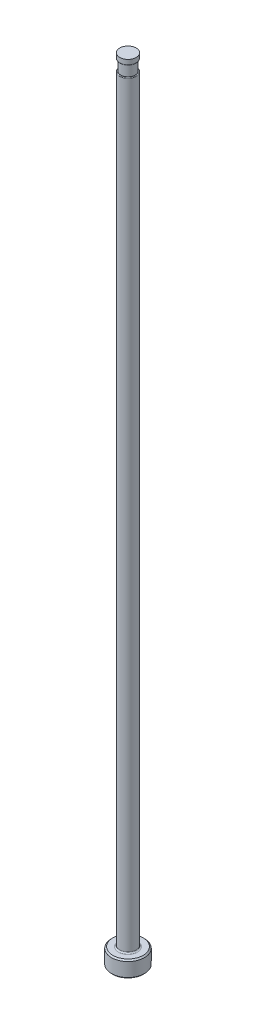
ISO-10303-21;
HEADER;
FILE_DESCRIPTION(('STEP AP214'),'2;1');
FILE_NAME('part.step','',(''),(''),'','','');
FILE_SCHEMA(('AUTOMOTIVE_DESIGN { 1 0 10303 214 1 1 1 1 }'));
ENDSEC;
DATA;
#1=APPLICATION_CONTEXT('core data for automotive mechanical design processes');
#2=APPLICATION_PROTOCOL_DEFINITION('international standard','automotive_design',2000,#1);
#3=PRODUCT_CONTEXT('',#1,'mechanical');
#4=PRODUCT('Part','Part','',(#3));
#5=PRODUCT_RELATED_PRODUCT_CATEGORY('part','',(#4));
#6=PRODUCT_DEFINITION_FORMATION('','',#4);
#7=PRODUCT_DEFINITION_CONTEXT('part definition',#1,'design');
#8=PRODUCT_DEFINITION('design','',#6,#7);
#9=PRODUCT_DEFINITION_SHAPE('','',#8);
#10=(LENGTH_UNIT() NAMED_UNIT(*) SI_UNIT(.MILLI.,.METRE.));
#11=(NAMED_UNIT(*) PLANE_ANGLE_UNIT() SI_UNIT($,.RADIAN.));
#12=(NAMED_UNIT(*) SI_UNIT($,.STERADIAN.) SOLID_ANGLE_UNIT());
#13=UNCERTAINTY_MEASURE_WITH_UNIT(LENGTH_MEASURE(1.E-05),#10,'distance_accuracy_value','');
#14=(GEOMETRIC_REPRESENTATION_CONTEXT(3) GLOBAL_UNCERTAINTY_ASSIGNED_CONTEXT((#13)) GLOBAL_UNIT_ASSIGNED_CONTEXT((#10,
#11,#12)) REPRESENTATION_CONTEXT('',''));
#15=CARTESIAN_POINT('',(0.,0.,0.));
#16=DIRECTION('',(0.,0.,1.));
#17=DIRECTION('',(1.,0.,0.));
#18=AXIS2_PLACEMENT_3D('',#15,#16,#17);
#19=CARTESIAN_POINT('',(-1.58749999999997,151.384,0.));
#20=DIRECTION('',(0.,1.,0.));
#21=DIRECTION('',(0.,0.,1.));
#22=AXIS2_PLACEMENT_3D('',#19,#20,#21);
#23=PLANE('',#22);
#24=CARTESIAN_POINT('',(0.,151.384,0.));
#25=DIRECTION('',(0.,1.,0.));
#26=DIRECTION('',(0.,0.,1.));
#27=AXIS2_PLACEMENT_3D('',#24,#25,#26);
#28=CIRCLE('',#27,1.45541999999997);
#29=CARTESIAN_POINT('',(0.,151.384,1.45541999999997));
#30=VERTEX_POINT('',#29);
#31=EDGE_CURVE('E11',#30,#30,#28,.F.);
#32=ORIENTED_EDGE('',*,*,#31,.T.);
#33=EDGE_LOOP('',(#32));
#34=FACE_BOUND('',#33,.T.);
#35=CARTESIAN_POINT('',(0.,151.384,0.));
#36=DIRECTION('',(0.,1.,0.));
#37=DIRECTION('',(0.,0.,1.));
#38=AXIS2_PLACEMENT_3D('',#35,#36,#37);
#39=CIRCLE('',#38,1.38429999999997);
#40=CARTESIAN_POINT('',(0.,151.384,1.38429999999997));
#41=VERTEX_POINT('',#40);
#42=EDGE_CURVE('E78',#41,#41,#39,.T.);
#43=ORIENTED_EDGE('',*,*,#42,.T.);
#44=EDGE_LOOP('',(#43));
#45=FACE_BOUND('',#44,.T.);
#46=ADVANCED_FACE('F36',(#34,#45),#23,.F.);
#47=CARTESIAN_POINT('',(0.,259.958771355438,0.));
#48=DIRECTION('',(0.,1.,0.));
#49=DIRECTION('',(0.,0.,1.));
#50=AXIS2_PLACEMENT_3D('',#47,#48,#49);
#51=CYLINDRICAL_SURFACE('',#50,1.58749999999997);
#52=DIRECTION('',(0.,1.,0.));
#53=VECTOR('',#52,1.);
#54=CARTESIAN_POINT('',(-1.38429999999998,259.958771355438,-0.777090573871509));
#55=LINE('',#54,#53);
#56=CARTESIAN_POINT('',(-1.38429999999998,149.225,-0.777090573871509));
#57=VERTEX_POINT('',#56);
#58=CARTESIAN_POINT('',(-1.38429999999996,86.868,-0.777090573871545));
#59=VERTEX_POINT('',#58);
#60=EDGE_CURVE('E73',#57,#59,#55,.F.);
#61=ORIENTED_EDGE('',*,*,#60,.F.);
#62=CARTESIAN_POINT('',(0.,149.225,0.));
#63=DIRECTION('',(0.,-1.,0.));
#64=DIRECTION('',(0.,0.,-1.));
#65=AXIS2_PLACEMENT_3D('',#62,#63,#64);
#66=CIRCLE('',#65,1.58749999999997);
#67=CARTESIAN_POINT('',(-1.38429999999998,149.225,0.777090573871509));
#68=VERTEX_POINT('',#67);
#69=EDGE_CURVE('E51',#57,#68,#66,.T.);
#70=ORIENTED_EDGE('',*,*,#69,.T.);
#71=DIRECTION('',(0.,1.,0.));
#72=VECTOR('',#71,1.);
#73=CARTESIAN_POINT('',(-1.38429999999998,259.958771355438,0.777090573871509));
#74=LINE('',#73,#72);
#75=CARTESIAN_POINT('',(-1.38429999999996,86.868,0.777090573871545));
#76=VERTEX_POINT('',#75);
#77=EDGE_CURVE('E84',#76,#68,#74,.T.);
#78=ORIENTED_EDGE('',*,*,#77,.F.);
#79=CARTESIAN_POINT('',(-1.38429999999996,86.868,-0.777090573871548));
#80=CARTESIAN_POINT('',(-1.38429609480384,86.8307272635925,-0.777082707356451));
#81=CARTESIAN_POINT('',(-1.38495631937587,86.7934527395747,-0.775921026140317));
#82=CARTESIAN_POINT('',(-1.38757712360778,86.7190763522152,-0.771232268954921));
#83=CARTESIAN_POINT('',(-1.38953849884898,86.6819746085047,-0.767703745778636));
#84=CARTESIAN_POINT('',(-1.39477495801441,86.6075790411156,-0.758148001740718));
#85=CARTESIAN_POINT('',(-1.39807044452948,86.570291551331,-0.752081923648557));
#86=CARTESIAN_POINT('',(-1.40590319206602,86.4963849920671,-0.737333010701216));
#87=CARTESIAN_POINT('',(-1.41044024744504,86.4597658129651,-0.728650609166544));
#88=CARTESIAN_POINT('',(-1.42582382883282,86.350986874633,-0.698367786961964));
#89=CARTESIAN_POINT('',(-1.43842338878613,86.2801687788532,-0.672562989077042));
#90=CARTESIAN_POINT('',(-1.46680838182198,86.1456572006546,-0.608160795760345));
#91=CARTESIAN_POINT('',(-1.48256997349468,86.0819156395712,-0.569657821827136));
#92=CARTESIAN_POINT('',(-1.50737283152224,85.9919333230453,-0.498685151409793));
#93=CARTESIAN_POINT('',(-1.51626333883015,85.9616802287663,-0.471232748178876));
#94=CARTESIAN_POINT('',(-1.53347485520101,85.9057865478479,-0.411785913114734));
#95=CARTESIAN_POINT('',(-1.54179640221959,85.8801415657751,-0.379795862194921));
#96=CARTESIAN_POINT('',(-1.55583338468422,85.8383277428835,-0.316871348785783));
#97=CARTESIAN_POINT('',(-1.56175286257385,85.8213042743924,-0.28655344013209));
#98=CARTESIAN_POINT('',(-1.57203785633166,85.79230135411,-0.223329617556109));
#99=CARTESIAN_POINT('',(-1.57640406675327,85.7803196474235,-0.190424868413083));
#100=CARTESIAN_POINT('',(-1.58312350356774,85.7620632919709,-0.122641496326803));
#101=CARTESIAN_POINT('',(-1.58546485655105,85.7558222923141,-0.0877524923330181));
#102=CARTESIAN_POINT('',(-1.58779523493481,85.7496097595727,-0.0173445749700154));
#103=CARTESIAN_POINT('',(-1.58778524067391,85.7496356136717,0.0181740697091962));
#104=CARTESIAN_POINT('',(-1.58553927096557,85.7556246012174,0.0850166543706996));
#105=CARTESIAN_POINT('',(-1.58352667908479,85.7609919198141,0.116403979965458));
#106=CARTESIAN_POINT('',(-1.57781194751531,85.7764774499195,0.177812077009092));
#107=CARTESIAN_POINT('',(-1.57410971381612,85.7865959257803,0.20783277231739));
#108=CARTESIAN_POINT('',(-1.56522233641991,85.8114483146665,0.266740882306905));
#109=CARTESIAN_POINT('',(-1.55999564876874,85.8263128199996,0.295566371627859));
#110=CARTESIAN_POINT('',(-1.54854541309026,85.8598843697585,0.350651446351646));
#111=CARTESIAN_POINT('',(-1.54232137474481,85.8785933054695,0.376909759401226));
#112=CARTESIAN_POINT('',(-1.52624085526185,85.928770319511,0.438380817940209));
#113=CARTESIAN_POINT('',(-1.51605337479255,85.9620994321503,0.471992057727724));
#114=CARTESIAN_POINT('',(-1.49561074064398,86.0338332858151,0.533246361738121));
#115=CARTESIAN_POINT('',(-1.48535548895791,86.0722487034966,0.560876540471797));
#116=CARTESIAN_POINT('',(-1.46194815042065,86.1678127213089,0.61985698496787));
#117=CARTESIAN_POINT('',(-1.44915247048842,86.2265828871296,0.648714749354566));
#118=CARTESIAN_POINT('',(-1.42648713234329,86.3484065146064,0.697138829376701));
#119=CARTESIAN_POINT('',(-1.41662511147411,86.4114706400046,0.716680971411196));
#120=CARTESIAN_POINT('',(-1.40064446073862,86.5398415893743,0.747428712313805));
#121=CARTESIAN_POINT('',(-1.39451475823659,86.6051411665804,0.758658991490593));
#122=CARTESIAN_POINT('',(-1.38838804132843,86.703622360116,0.769772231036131));
#123=CARTESIAN_POINT('',(-1.38685717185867,86.7364222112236,0.772521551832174));
#124=CARTESIAN_POINT('',(-1.38481284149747,86.8021449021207,0.776178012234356));
#125=CARTESIAN_POINT('',(-1.38429902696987,86.8350676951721,0.777085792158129));
#126=CARTESIAN_POINT('',(-1.38429999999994,86.8679999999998,0.777090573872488));
#127=B_SPLINE_CURVE_WITH_KNOTS('',3,(#79,#80,#81,#82,#83,#84,#85,#86,#87,#88,#89,#90,#91,#92,
#93,#94,#95,#96,#97,#98,#99,#100,#101,#102,#103,#104,#105,#106,#107,#108,#109,#110,#111,#112,
#113,#114,#115,#116,#117,#118,#119,#120,#121,#122,#123,#124,#125,#126),.UNSPECIFIED.,.F.,.F.,(4,
2,2,2,2,2,2,2,2,2,2,2,2,2,2,2,2,2,2,2,2,2,2,4),(0.,0.111796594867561,0.22366161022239,
0.33730621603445,0.450932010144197,0.678971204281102,0.905351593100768,1.03037322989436,
1.1552749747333,1.26065408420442,1.36598601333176,1.47193148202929,1.57783277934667,
1.67311136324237,1.76839524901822,1.86656705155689,1.96478726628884,2.10923104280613,
2.25398297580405,2.45303424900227,2.65259927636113,2.85156933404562,2.95036438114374,
3.04912507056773),.UNSPECIFIED.);
#128=EDGE_CURVE('E81',#59,#76,#127,.T.);
#129=ORIENTED_EDGE('',*,*,#128,.F.);
#130=EDGE_LOOP('',(#61,#70,#78,#129));
#131=FACE_BOUND('',#130,.T.);
#132=CARTESIAN_POINT('',(0.,3.42900000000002,0.));
#133=DIRECTION('',(0.,1.,0.));
#134=DIRECTION('',(0.,0.,1.));
#135=AXIS2_PLACEMENT_3D('',#132,#133,#134);
#136=CIRCLE('',#135,1.58749999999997);
#137=CARTESIAN_POINT('',(0.,3.42900000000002,1.58749999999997));
#138=VERTEX_POINT('',#137);
#139=EDGE_CURVE('E116',#138,#138,#136,.T.);
#140=ORIENTED_EDGE('',*,*,#139,.T.);
#141=EDGE_LOOP('',(#140));
#142=FACE_BOUND('',#141,.T.);
#143=ADVANCED_FACE('F82',(#131,#142),#51,.T.);
#144=CARTESIAN_POINT('',(0.,0.,0.));
#145=DIRECTION('',(0.,-1.,0.));
#146=DIRECTION('',(0.,0.,-1.));
#147=AXIS2_PLACEMENT_3D('',#144,#145,#146);
#148=PLANE('',#147);
#149=CARTESIAN_POINT('',(0.,0.,0.));
#150=DIRECTION('',(0.,-1.,0.));
#151=DIRECTION('',(0.,0.,-1.));
#152=AXIS2_PLACEMENT_3D('',#149,#150,#151);
#153=CIRCLE('',#152,2.92099999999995);
#154=CARTESIAN_POINT('',(0.,0.,-2.92099999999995));
#155=VERTEX_POINT('',#154);
#156=EDGE_CURVE('E113',#155,#155,#153,.T.);
#157=ORIENTED_EDGE('',*,*,#156,.T.);
#158=EDGE_LOOP('',(#157));
#159=FACE_BOUND('',#158,.T.);
#160=ADVANCED_FACE('F192',(#159),#148,.T.);
#161=CARTESIAN_POINT('',(0.,259.958771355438,0.));
#162=DIRECTION('',(0.,1.,0.));
#163=DIRECTION('',(0.,0.,1.));
#164=AXIS2_PLACEMENT_3D('',#161,#162,#163);
#165=CYLINDRICAL_SURFACE('',#164,3.17499999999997);
#166=CARTESIAN_POINT('',(0.,2.92100000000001,0.));
#167=DIRECTION('',(0.,1.,0.));
#168=DIRECTION('',(0.,0.,1.));
#169=AXIS2_PLACEMENT_3D('',#166,#167,#168);
#170=CIRCLE('',#169,3.17499999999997);
#171=CARTESIAN_POINT('',(0.,2.92100000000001,3.17499999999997));
#172=VERTEX_POINT('',#171);
#173=EDGE_CURVE('E110',#172,#172,#170,.F.);
#174=ORIENTED_EDGE('',*,*,#173,.T.);
#175=EDGE_LOOP('',(#174));
#176=FACE_BOUND('',#175,.T.);
#177=CARTESIAN_POINT('',(0.,0.254000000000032,0.));
#178=DIRECTION('',(0.,-1.,0.));
#179=DIRECTION('',(0.,0.,-1.));
#180=AXIS2_PLACEMENT_3D('',#177,#178,#179);
#181=CIRCLE('',#180,3.17499999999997);
#182=CARTESIAN_POINT('',(0.,0.254000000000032,-3.17499999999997));
#183=VERTEX_POINT('',#182);
#184=EDGE_CURVE('E107',#183,#183,#181,.F.);
#185=ORIENTED_EDGE('',*,*,#184,.T.);
#186=EDGE_LOOP('',(#185));
#187=FACE_BOUND('',#186,.T.);
#188=ADVANCED_FACE('F195',(#176,#187),#165,.T.);
#189=CARTESIAN_POINT('',(-3.17499999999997,3.175,0.));
#190=DIRECTION('',(0.,1.,0.));
#191=DIRECTION('',(0.,0.,1.));
#192=AXIS2_PLACEMENT_3D('',#189,#190,#191);
#193=PLANE('',#192);
#194=CARTESIAN_POINT('',(0.,3.175,0.));
#195=DIRECTION('',(0.,1.,0.));
#196=DIRECTION('',(0.,0.,1.));
#197=AXIS2_PLACEMENT_3D('',#194,#195,#196);
#198=CIRCLE('',#197,1.84149999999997);
#199=CARTESIAN_POINT('',(0.,3.175,1.84149999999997));
#200=VERTEX_POINT('',#199);
#201=EDGE_CURVE('E87',#200,#200,#198,.F.);
#202=ORIENTED_EDGE('',*,*,#201,.T.);
#203=EDGE_LOOP('',(#202));
#204=FACE_BOUND('',#203,.T.);
#205=CARTESIAN_POINT('',(0.,3.175,0.));
#206=DIRECTION('',(0.,1.,0.));
#207=DIRECTION('',(0.,0.,1.));
#208=AXIS2_PLACEMENT_3D('',#205,#206,#207);
#209=CIRCLE('',#208,2.92099999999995);
#210=CARTESIAN_POINT('',(0.,3.175,2.92099999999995));
#211=VERTEX_POINT('',#210);
#212=EDGE_CURVE('E104',#211,#211,#209,.T.);
#213=ORIENTED_EDGE('',*,*,#212,.T.);
#214=EDGE_LOOP('',(#213));
#215=FACE_BOUND('',#214,.T.);
#216=ADVANCED_FACE('F190',(#204,#215),#193,.T.);
#217=CARTESIAN_POINT('',(0.,3.17499999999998,0.));
#218=DIRECTION('',(0.,-1.,0.));
#219=DIRECTION('',(0.,0.,-1.));
#220=AXIS2_PLACEMENT_3D('',#217,#218,#219);
#221=CONICAL_SURFACE('',#220,2.92099999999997,0.7853981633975);
#222=ORIENTED_EDGE('',*,*,#173,.F.);
#223=EDGE_LOOP('',(#222));
#224=FACE_BOUND('',#223,.T.);
#225=ORIENTED_EDGE('',*,*,#212,.F.);
#226=EDGE_LOOP('',(#225));
#227=FACE_BOUND('',#226,.T.);
#228=ADVANCED_FACE('F186',(#224,#227),#221,.T.);
#229=CARTESIAN_POINT('',(0.,0.254000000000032,0.));
#230=DIRECTION('',(0.,1.,0.));
#231=DIRECTION('',(0.,0.,1.));
#232=AXIS2_PLACEMENT_3D('',#229,#230,#231);
#233=CONICAL_SURFACE('',#232,3.17499999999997,0.785398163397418);
#234=ORIENTED_EDGE('',*,*,#156,.F.);
#235=EDGE_LOOP('',(#234));
#236=FACE_BOUND('',#235,.T.);
#237=ORIENTED_EDGE('',*,*,#184,.F.);
#238=EDGE_LOOP('',(#237));
#239=FACE_BOUND('',#238,.T.);
#240=ADVANCED_FACE('F182',(#236,#239),#233,.T.);
#241=CARTESIAN_POINT('',(0.,3.42900000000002,0.));
#242=DIRECTION('',(0.,1.,0.));
#243=DIRECTION('',(0.,0.,1.));
#244=AXIS2_PLACEMENT_3D('',#241,#242,#243);
#245=TOROIDAL_SURFACE('',#244,1.84149999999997,0.254);
#246=ORIENTED_EDGE('',*,*,#201,.F.);
#247=EDGE_LOOP('',(#246));
#248=FACE_BOUND('',#247,.T.);
#249=ORIENTED_EDGE('',*,*,#139,.F.);
#250=EDGE_LOOP('',(#249));
#251=FACE_BOUND('',#250,.T.);
#252=ADVANCED_FACE('F147',(#248,#251),#245,.F.);
#253=CARTESIAN_POINT('',(-1.58749999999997,149.352,0.));
#254=DIRECTION('',(0.,-1.,0.));
#255=DIRECTION('',(0.,0.,-1.));
#256=AXIS2_PLACEMENT_3D('',#253,#254,#255);
#257=PLANE('',#256);
#258=DIRECTION('',(0.,0.,1.));
#259=VECTOR('',#258,1.);
#260=CARTESIAN_POINT('',(-1.38429999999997,149.352,0.));
#261=LINE('',#260,#259);
#262=CARTESIAN_POINT('',(-1.38429999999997,149.352,0.));
#263=VERTEX_POINT('',#262);
#264=CARTESIAN_POINT('',(-1.38429999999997,149.352,0.465589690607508));
#265=VERTEX_POINT('',#264);
#266=EDGE_CURVE('E90',#263,#265,#261,.T.);
#267=ORIENTED_EDGE('',*,*,#266,.T.);
#268=CARTESIAN_POINT('',(0.,149.352,0.));
#269=DIRECTION('',(0.,-1.,0.));
#270=DIRECTION('',(0.,0.,-1.));
#271=AXIS2_PLACEMENT_3D('',#268,#269,#270);
#272=CIRCLE('',#271,1.46049999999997);
#273=CARTESIAN_POINT('',(-1.38429999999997,149.352,-0.465589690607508));
#274=VERTEX_POINT('',#273);
#275=EDGE_CURVE('E86',#265,#274,#272,.F.);
#276=ORIENTED_EDGE('',*,*,#275,.T.);
#277=EDGE_CURVE('E79',#274,#263,#261,.T.);
#278=ORIENTED_EDGE('',*,*,#277,.T.);
#279=CARTESIAN_POINT('',(0.,149.352,0.));
#280=DIRECTION('',(0.,1.,0.));
#281=DIRECTION('',(0.,0.,1.));
#282=AXIS2_PLACEMENT_3D('',#279,#280,#281);
#283=CIRCLE('',#282,1.38429999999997);
#284=EDGE_CURVE('E101',#263,#263,#283,.T.);
#285=ORIENTED_EDGE('',*,*,#284,.F.);
#286=EDGE_LOOP('',(#267,#276,#278,#285));
#287=FACE_BOUND('',#286,.T.);
#288=ADVANCED_FACE('F144',(#287),#257,.F.);
#289=CARTESIAN_POINT('',(0.,153.448281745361,0.));
#290=DIRECTION('',(0.,1.,0.));
#291=DIRECTION('',(0.,0.,1.));
#292=AXIS2_PLACEMENT_3D('',#289,#290,#291);
#293=CYLINDRICAL_SURFACE('',#292,1.38429999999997);
#294=ORIENTED_EDGE('',*,*,#42,.F.);
#295=EDGE_LOOP('',(#294));
#296=FACE_BOUND('',#295,.T.);
#297=ORIENTED_EDGE('',*,*,#284,.T.);
#298=EDGE_LOOP('',(#297));
#299=FACE_BOUND('',#298,.T.);
#300=ADVANCED_FACE('F141',(#296,#299),#293,.T.);
#301=CARTESIAN_POINT('',(-1.38429999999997,150.368,-3.17499999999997));
#302=DIRECTION('',(1.,0.,0.));
#303=DIRECTION('',(0.,1.,0.));
#304=AXIS2_PLACEMENT_3D('',#301,#302,#303);
#305=PLANE('',#304);
#306=ORIENTED_EDGE('',*,*,#277,.F.);
#307=CARTESIAN_POINT('',(-1.38429999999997,149.352,-0.465589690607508));
#308=CARTESIAN_POINT('',(-1.38429999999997,149.351994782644,-0.479559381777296));
#309=CARTESIAN_POINT('',(-1.38429999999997,149.351765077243,-0.493535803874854));
#310=CARTESIAN_POINT('',(-1.38429999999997,149.350708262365,-0.521508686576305));
#311=CARTESIAN_POINT('',(-1.38429999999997,149.349879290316,-0.535505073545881));
#312=CARTESIAN_POINT('',(-1.38429999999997,149.347476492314,-0.563404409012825));
#313=CARTESIAN_POINT('',(-1.38429999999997,149.345904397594,-0.577307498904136));
#314=CARTESIAN_POINT('',(-1.38429999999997,149.341817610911,-0.604962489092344));
#315=CARTESIAN_POINT('',(-1.38429999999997,149.339304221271,-0.618714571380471));
#316=CARTESIAN_POINT('',(-1.38429999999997,149.334078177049,-0.641494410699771));
#317=CARTESIAN_POINT('',(-1.38429999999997,149.331698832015,-0.650597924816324));
#318=CARTESIAN_POINT('',(-1.38429999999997,149.326254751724,-0.668645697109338));
#319=CARTESIAN_POINT('',(-1.38429999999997,149.323187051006,-0.677589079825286));
#320=CARTESIAN_POINT('',(-1.38429999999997,149.315185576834,-0.697758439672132));
#321=CARTESIAN_POINT('',(-1.38429999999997,149.309968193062,-0.708874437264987));
#322=CARTESIAN_POINT('',(-1.38429999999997,149.29765165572,-0.7300023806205));
#323=CARTESIAN_POINT('',(-1.38429999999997,149.290567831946,-0.740022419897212));
#324=CARTESIAN_POINT('',(-1.38429999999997,149.27908447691,-0.752196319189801));
#325=CARTESIAN_POINT('',(-1.38429999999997,149.275763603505,-0.75536058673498));
#326=CARTESIAN_POINT('',(-1.38429999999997,149.268727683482,-0.761230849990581));
#327=CARTESIAN_POINT('',(-1.38429999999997,149.265012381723,-0.763936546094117));
#328=CARTESIAN_POINT('',(-1.38429999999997,149.257139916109,-0.768755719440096));
#329=CARTESIAN_POINT('',(-1.38429999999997,149.252977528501,-0.770860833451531));
#330=CARTESIAN_POINT('',(-1.38429999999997,149.244327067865,-0.774221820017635));
#331=CARTESIAN_POINT('',(-1.38429999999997,149.239840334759,-0.775480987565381));
#332=CARTESIAN_POINT('',(-1.38429999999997,149.23357988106,-0.776521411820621));
#333=CARTESIAN_POINT('',(-1.38429999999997,149.231871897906,-0.776734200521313));
#334=CARTESIAN_POINT('',(-1.38429999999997,149.228442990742,-0.777018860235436));
#335=CARTESIAN_POINT('',(-1.38429999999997,149.226722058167,-0.77709062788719));
#336=CARTESIAN_POINT('',(-1.38429999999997,149.225,-0.777090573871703));
#337=B_SPLINE_CURVE_WITH_KNOTS('',3,(#307,#308,#309,#310,#311,#312,#313,#314,#315,#316,#317,
#318,#319,#320,#321,#322,#323,#324,#325,#326,#327,#328,#329,#330,#331,#332,#333,#334,#335,#336),
.UNSPECIFIED.,.F.,.F.,(4,2,2,2,2,2,2,2,2,2,2,2,2,2,4),(0.,0.0419176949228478,0.0839662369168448,
0.125917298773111,0.167810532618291,0.196018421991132,0.224350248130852,0.261087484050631,
0.29753191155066,0.311262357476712,0.325001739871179,0.338924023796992,0.352791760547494,
0.357950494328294,0.363113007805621),.UNSPECIFIED.);
#338=EDGE_CURVE('E59',#274,#57,#337,.T.);
#339=ORIENTED_EDGE('',*,*,#338,.T.);
#340=ORIENTED_EDGE('',*,*,#60,.T.);
#341=DIRECTION('',(0.,0.,1.));
#342=VECTOR('',#341,1.);
#343=CARTESIAN_POINT('',(-1.38429999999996,86.868,-3.17499999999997));
#344=LINE('',#343,#342);
#345=EDGE_CURVE('E77',#59,#76,#344,.T.);
#346=ORIENTED_EDGE('',*,*,#345,.T.);
#347=ORIENTED_EDGE('',*,*,#77,.T.);
#348=CARTESIAN_POINT('',(-1.38429999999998,149.225,0.777090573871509));
#349=CARTESIAN_POINT('',(-1.38429999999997,149.228750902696,0.777099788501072));
#350=CARTESIAN_POINT('',(-1.38429999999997,149.2324915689,0.776751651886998));
#351=CARTESIAN_POINT('',(-1.38429999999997,149.239825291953,0.775421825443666));
#352=CARTESIAN_POINT('',(-1.38429999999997,149.243419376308,0.774445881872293));
#353=CARTESIAN_POINT('',(-1.38429999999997,149.250393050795,0.771942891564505));
#354=CARTESIAN_POINT('',(-1.38429999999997,149.253773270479,0.770417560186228));
#355=CARTESIAN_POINT('',(-1.38429999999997,149.260296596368,0.766915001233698));
#356=CARTESIAN_POINT('',(-1.38429999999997,149.26343911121,0.764936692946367));
#357=CARTESIAN_POINT('',(-1.38429999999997,149.271606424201,0.759093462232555));
#358=CARTESIAN_POINT('',(-1.38429999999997,149.276385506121,0.754885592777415));
#359=CARTESIAN_POINT('',(-1.38429999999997,149.285244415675,0.745791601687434));
#360=CARTESIAN_POINT('',(-1.38429999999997,149.289322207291,0.740903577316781));
#361=CARTESIAN_POINT('',(-1.38429999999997,149.299805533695,0.726719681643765));
#362=CARTESIAN_POINT('',(-1.38429999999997,149.305560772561,0.71694762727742));
#363=CARTESIAN_POINT('',(-1.38429999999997,149.315646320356,0.696707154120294));
#364=CARTESIAN_POINT('',(-1.38429999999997,149.319972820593,0.686236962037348));
#365=CARTESIAN_POINT('',(-1.38429999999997,149.328704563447,0.661619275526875));
#366=CARTESIAN_POINT('',(-1.38429999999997,149.332720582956,0.647335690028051));
#367=CARTESIAN_POINT('',(-1.38429999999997,149.339382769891,0.618445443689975));
#368=CARTESIAN_POINT('',(-1.38429999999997,149.34202632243,0.603838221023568));
#369=CARTESIAN_POINT('',(-1.38429999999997,149.348406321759,0.559733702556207));
#370=CARTESIAN_POINT('',(-1.38429999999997,149.350575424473,0.530010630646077));
#371=CARTESIAN_POINT('',(-1.38429999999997,149.351661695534,0.494502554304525));
#372=CARTESIAN_POINT('',(-1.38429999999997,149.351791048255,0.488707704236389));
#373=CARTESIAN_POINT('',(-1.38429999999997,149.351960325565,0.477139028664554));
#374=CARTESIAN_POINT('',(-1.38429999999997,149.352000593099,0.471365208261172));
#375=CARTESIAN_POINT('',(-1.38429999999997,149.352,0.465589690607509));
#376=B_SPLINE_CURVE_WITH_KNOTS('',3,(#348,#349,#350,#351,#352,#353,#354,#355,#356,#357,#358,
#359,#360,#361,#362,#363,#364,#365,#366,#367,#368,#369,#370,#371,#372,#373,#374,#375),
.UNSPECIFIED.,.F.,.F.,(4,2,2,2,2,2,2,2,2,2,2,2,2,4),(0.,0.0112203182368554,0.0223393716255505,
0.0334240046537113,0.0445353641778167,0.0635271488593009,0.0825731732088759,0.116404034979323,
0.150324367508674,0.194732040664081,0.239224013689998,0.328384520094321,0.345774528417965,
0.36309747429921),.UNSPECIFIED.);
#377=EDGE_CURVE('E172',#68,#265,#376,.T.);
#378=ORIENTED_EDGE('',*,*,#377,.T.);
#379=ORIENTED_EDGE('',*,*,#266,.F.);
#380=EDGE_LOOP('',(#306,#339,#340,#346,#347,#378,#379));
#381=FACE_BOUND('',#380,.T.);
#382=ADVANCED_FACE('F75',(#381),#305,.F.);
#383=CARTESIAN_POINT('',(-4.55929999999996,86.868,-3.17499999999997));
#384=DIRECTION('',(0.,0.,1.));
#385=DIRECTION('',(1.,0.,0.));
#386=AXIS2_PLACEMENT_3D('',#383,#384,#385);
#387=CYLINDRICAL_SURFACE('',#386,3.175);
#388=ORIENTED_EDGE('',*,*,#345,.F.);
#389=ORIENTED_EDGE('',*,*,#128,.T.);
#390=EDGE_LOOP('',(#388,#389));
#391=FACE_BOUND('',#390,.T.);
#392=ADVANCED_FACE('F89',(#391),#387,.F.);
#393=CARTESIAN_POINT('',(0.,152.687735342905,0.));
#394=DIRECTION('',(0.,1.,0.));
#395=DIRECTION('',(0.,0.,1.));
#396=AXIS2_PLACEMENT_3D('',#393,#394,#395);
#397=CYLINDRICAL_SURFACE('',#396,1.58241999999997);
#398=CARTESIAN_POINT('',(0.,151.511,0.));
#399=DIRECTION('',(0.,1.,0.));
#400=DIRECTION('',(0.,0.,1.));
#401=AXIS2_PLACEMENT_3D('',#398,#399,#400);
#402=CIRCLE('',#401,1.58241999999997);
#403=CARTESIAN_POINT('',(0.,151.511,1.58241999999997));
#404=VERTEX_POINT('',#403);
#405=EDGE_CURVE('E44',#404,#404,#402,.T.);
#406=ORIENTED_EDGE('',*,*,#405,.T.);
#407=EDGE_LOOP('',(#406));
#408=FACE_BOUND('',#407,.T.);
#409=CARTESIAN_POINT('',(0.,152.4,0.));
#410=DIRECTION('',(0.,1.,0.));
#411=DIRECTION('',(0.,0.,1.));
#412=AXIS2_PLACEMENT_3D('',#409,#410,#411);
#413=CIRCLE('',#412,1.58241999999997);
#414=CARTESIAN_POINT('',(0.,152.4,1.58241999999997));
#415=VERTEX_POINT('',#414);
#416=EDGE_CURVE('E91',#415,#415,#413,.T.);
#417=ORIENTED_EDGE('',*,*,#416,.F.);
#418=EDGE_LOOP('',(#417));
#419=FACE_BOUND('',#418,.T.);
#420=ADVANCED_FACE('F135',(#408,#419),#397,.T.);
#421=CARTESIAN_POINT('',(-1.58749999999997,152.4,0.));
#422=DIRECTION('',(0.,1.,0.));
#423=DIRECTION('',(0.,0.,1.));
#424=AXIS2_PLACEMENT_3D('',#421,#422,#423);
#425=PLANE('',#424);
#426=ORIENTED_EDGE('',*,*,#416,.T.);
#427=EDGE_LOOP('',(#426));
#428=FACE_BOUND('',#427,.T.);
#429=ADVANCED_FACE('F149',(#428),#425,.T.);
#430=CARTESIAN_POINT('',(0.,149.225,0.));
#431=DIRECTION('',(0.,-1.,0.));
#432=DIRECTION('',(0.,0.,-1.));
#433=AXIS2_PLACEMENT_3D('',#430,#431,#432);
#434=TOROIDAL_SURFACE('',#433,1.46049999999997,0.127);
#435=ORIENTED_EDGE('',*,*,#377,.F.);
#436=ORIENTED_EDGE('',*,*,#69,.F.);
#437=ORIENTED_EDGE('',*,*,#338,.F.);
#438=ORIENTED_EDGE('',*,*,#275,.F.);
#439=EDGE_LOOP('',(#435,#436,#437,#438));
#440=FACE_BOUND('',#439,.T.);
#441=ADVANCED_FACE('F151',(#440),#434,.T.);
#442=CARTESIAN_POINT('',(0.,151.511,0.));
#443=DIRECTION('',(0.,1.,0.));
#444=DIRECTION('',(0.,0.,1.));
#445=AXIS2_PLACEMENT_3D('',#442,#443,#444);
#446=TOROIDAL_SURFACE('',#445,1.45541999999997,0.127);
#447=ORIENTED_EDGE('',*,*,#31,.F.);
#448=EDGE_LOOP('',(#447));
#449=FACE_BOUND('',#448,.T.);
#450=ORIENTED_EDGE('',*,*,#405,.F.);
#451=EDGE_LOOP('',(#450));
#452=FACE_BOUND('',#451,.T.);
#453=ADVANCED_FACE('F38',(#449,#452),#446,.T.);
#454=CLOSED_SHELL('',(#46,#143,#160,#188,#216,#228,#240,#252,#288,#300,#382,#392,#420,#429,#441,#453));
#455=MANIFOLD_SOLID_BREP('B2',#454);
#456=ADVANCED_BREP_SHAPE_REPRESENTATION('',(#18,#455),#14);
#457=SHAPE_DEFINITION_REPRESENTATION(#9,#456);
ENDSEC;
END-ISO-10303-21;
